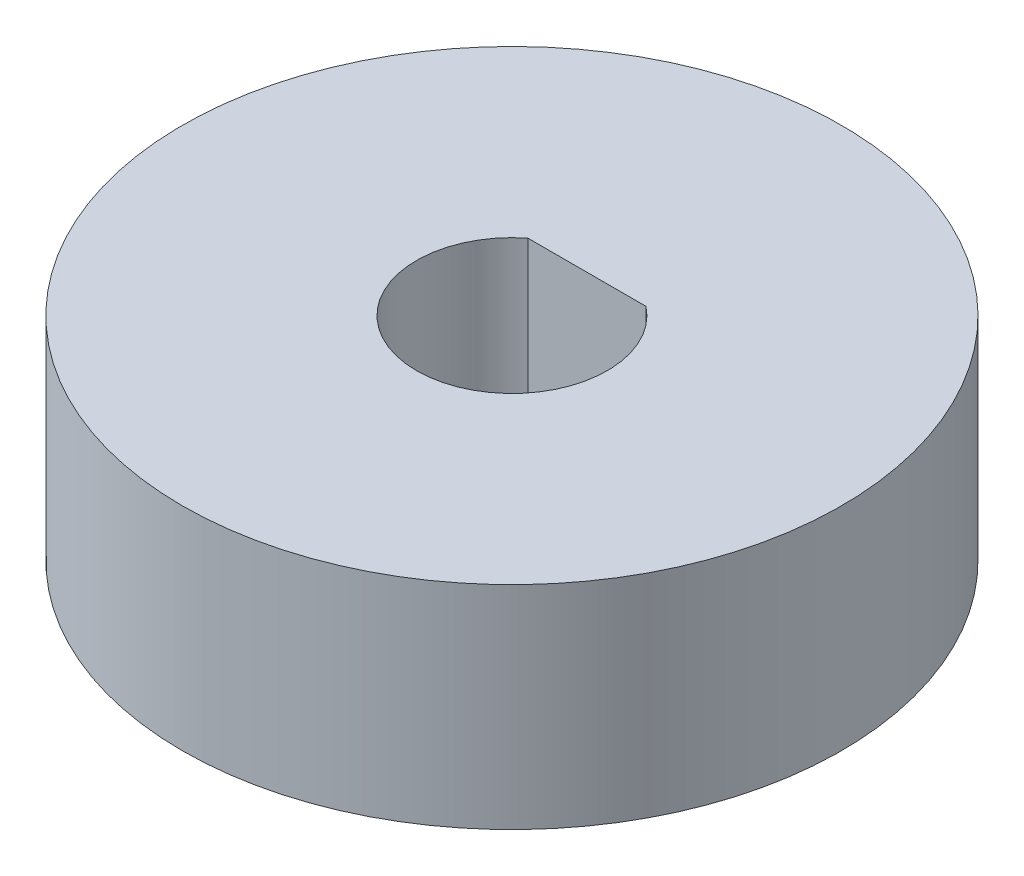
ISO-10303-21;
HEADER;
FILE_DESCRIPTION(('STEP AP214'),'2;1');
FILE_NAME('part.step','',(''),(''),'','','');
FILE_SCHEMA(('AUTOMOTIVE_DESIGN { 1 0 10303 214 1 1 1 1 }'));
ENDSEC;
DATA;
#1=APPLICATION_CONTEXT('core data for automotive mechanical design processes');
#2=APPLICATION_PROTOCOL_DEFINITION('international standard','automotive_design',2000,#1);
#3=PRODUCT_CONTEXT('',#1,'mechanical');
#4=PRODUCT('Part','Part','',(#3));
#5=PRODUCT_RELATED_PRODUCT_CATEGORY('part','',(#4));
#6=PRODUCT_DEFINITION_FORMATION('','',#4);
#7=PRODUCT_DEFINITION_CONTEXT('part definition',#1,'design');
#8=PRODUCT_DEFINITION('design','',#6,#7);
#9=PRODUCT_DEFINITION_SHAPE('','',#8);
#10=(LENGTH_UNIT() NAMED_UNIT(*) SI_UNIT(.MILLI.,.METRE.));
#11=(NAMED_UNIT(*) PLANE_ANGLE_UNIT() SI_UNIT($,.RADIAN.));
#12=(NAMED_UNIT(*) SI_UNIT($,.STERADIAN.) SOLID_ANGLE_UNIT());
#13=UNCERTAINTY_MEASURE_WITH_UNIT(LENGTH_MEASURE(1.E-05),#10,'distance_accuracy_value','');
#14=(GEOMETRIC_REPRESENTATION_CONTEXT(3) GLOBAL_UNCERTAINTY_ASSIGNED_CONTEXT((#13)) GLOBAL_UNIT_ASSIGNED_CONTEXT((#10,
#11,#12)) REPRESENTATION_CONTEXT('',''));
#15=CARTESIAN_POINT('',(0.,0.,0.));
#16=DIRECTION('',(0.,0.,1.));
#17=DIRECTION('',(1.,0.,0.));
#18=AXIS2_PLACEMENT_3D('',#15,#16,#17);
#19=CARTESIAN_POINT('',(0.,7.,0.));
#20=DIRECTION('',(0.,1.,0.));
#21=DIRECTION('',(0.,0.,1.));
#22=AXIS2_PLACEMENT_3D('',#19,#20,#21);
#23=PLANE('',#22);
#24=CARTESIAN_POINT('',(0.,7.,0.));
#25=DIRECTION('',(0.,1.,0.));
#26=DIRECTION('',(0.,0.,1.));
#27=AXIS2_PLACEMENT_3D('',#24,#25,#26);
#28=CIRCLE('',#27,10.875);
#29=CARTESIAN_POINT('',(0.,7.,10.875));
#30=VERTEX_POINT('',#29);
#31=EDGE_CURVE('E11',#30,#30,#28,.T.);
#32=ORIENTED_EDGE('',*,*,#31,.T.);
#33=EDGE_LOOP('',(#32));
#34=FACE_BOUND('',#33,.T.);
#35=DIRECTION('',(-1.,0.,0.));
#36=VECTOR('',#35,1.);
#37=CARTESIAN_POINT('',(1.94779481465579,7.,-2.4756));
#38=LINE('',#37,#36);
#39=CARTESIAN_POINT('',(1.94779481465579,7.,-2.4756));
#40=VERTEX_POINT('',#39);
#41=CARTESIAN_POINT('',(-1.94779481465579,7.,-2.4756));
#42=VERTEX_POINT('',#41);
#43=EDGE_CURVE('E72',#40,#42,#38,.T.);
#44=ORIENTED_EDGE('',*,*,#43,.F.);
#45=CARTESIAN_POINT('',(0.,7.,0.));
#46=DIRECTION('',(0.,1.,0.));
#47=DIRECTION('',(0.,0.,1.));
#48=AXIS2_PLACEMENT_3D('',#45,#46,#47);
#49=CIRCLE('',#48,3.15);
#50=EDGE_CURVE('E63',#42,#40,#49,.T.);
#51=ORIENTED_EDGE('',*,*,#50,.F.);
#52=EDGE_LOOP('',(#44,#51));
#53=FACE_BOUND('',#52,.T.);
#54=ADVANCED_FACE('F31',(#34,#53),#23,.T.);
#55=CARTESIAN_POINT('',(0.,0.,0.));
#56=DIRECTION('',(0.,1.,0.));
#57=DIRECTION('',(0.,0.,1.));
#58=AXIS2_PLACEMENT_3D('',#55,#56,#57);
#59=PLANE('',#58);
#60=CARTESIAN_POINT('',(0.,0.,0.));
#61=DIRECTION('',(0.,1.,0.));
#62=DIRECTION('',(0.,0.,1.));
#63=AXIS2_PLACEMENT_3D('',#60,#61,#62);
#64=CIRCLE('',#63,10.875);
#65=CARTESIAN_POINT('',(0.,0.,10.875));
#66=VERTEX_POINT('',#65);
#67=EDGE_CURVE('E35',#66,#66,#64,.T.);
#68=ORIENTED_EDGE('',*,*,#67,.F.);
#69=EDGE_LOOP('',(#68));
#70=FACE_BOUND('',#69,.T.);
#71=CARTESIAN_POINT('',(0.,0.,0.));
#72=DIRECTION('',(0.,1.,0.));
#73=DIRECTION('',(0.,0.,1.));
#74=AXIS2_PLACEMENT_3D('',#71,#72,#73);
#75=CIRCLE('',#74,3.15);
#76=CARTESIAN_POINT('',(-1.94779481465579,0.,-2.4756));
#77=VERTEX_POINT('',#76);
#78=CARTESIAN_POINT('',(1.94779481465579,0.,-2.4756));
#79=VERTEX_POINT('',#78);
#80=EDGE_CURVE('E53',#77,#79,#75,.T.);
#81=ORIENTED_EDGE('',*,*,#80,.T.);
#82=DIRECTION('',(-1.,0.,0.));
#83=VECTOR('',#82,1.);
#84=CARTESIAN_POINT('',(1.94779481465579,0.,-2.4756));
#85=LINE('',#84,#83);
#86=EDGE_CURVE('E59',#79,#77,#85,.T.);
#87=ORIENTED_EDGE('',*,*,#86,.T.);
#88=EDGE_LOOP('',(#81,#87));
#89=FACE_BOUND('',#88,.T.);
#90=ADVANCED_FACE('F69',(#70,#89),#59,.F.);
#91=CARTESIAN_POINT('',(0.,7.,0.));
#92=DIRECTION('',(0.,-1.,0.));
#93=DIRECTION('',(0.,0.,-1.));
#94=AXIS2_PLACEMENT_3D('',#91,#92,#93);
#95=CYLINDRICAL_SURFACE('',#94,10.875);
#96=ORIENTED_EDGE('',*,*,#31,.F.);
#97=EDGE_LOOP('',(#96));
#98=FACE_BOUND('',#97,.T.);
#99=ORIENTED_EDGE('',*,*,#67,.T.);
#100=EDGE_LOOP('',(#99));
#101=FACE_BOUND('',#100,.T.);
#102=ADVANCED_FACE('F33',(#98,#101),#95,.T.);
#103=CARTESIAN_POINT('',(0.,7.,0.));
#104=DIRECTION('',(0.,-1.,0.));
#105=DIRECTION('',(0.,0.,-1.));
#106=AXIS2_PLACEMENT_3D('',#103,#104,#105);
#107=CYLINDRICAL_SURFACE('',#106,3.15);
#108=ORIENTED_EDGE('',*,*,#80,.F.);
#109=DIRECTION('',(0.,-1.,0.));
#110=VECTOR('',#109,1.);
#111=CARTESIAN_POINT('',(-1.94779481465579,7.,-2.4756));
#112=LINE('',#111,#110);
#113=EDGE_CURVE('E61',#42,#77,#112,.T.);
#114=ORIENTED_EDGE('',*,*,#113,.F.);
#115=ORIENTED_EDGE('',*,*,#50,.T.);
#116=DIRECTION('',(0.,-1.,0.));
#117=VECTOR('',#116,1.);
#118=CARTESIAN_POINT('',(1.94779481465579,7.,-2.4756));
#119=LINE('',#118,#117);
#120=EDGE_CURVE('E46',#40,#79,#119,.T.);
#121=ORIENTED_EDGE('',*,*,#120,.T.);
#122=EDGE_LOOP('',(#108,#114,#115,#121));
#123=FACE_BOUND('',#122,.T.);
#124=ADVANCED_FACE('F65',(#123),#107,.F.);
#125=CARTESIAN_POINT('',(1.94779481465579,7.,-2.4756));
#126=DIRECTION('',(0.,0.,1.));
#127=DIRECTION('',(1.,0.,0.));
#128=AXIS2_PLACEMENT_3D('',#125,#126,#127);
#129=PLANE('',#128);
#130=ORIENTED_EDGE('',*,*,#86,.F.);
#131=ORIENTED_EDGE('',*,*,#120,.F.);
#132=ORIENTED_EDGE('',*,*,#43,.T.);
#133=ORIENTED_EDGE('',*,*,#113,.T.);
#134=EDGE_LOOP('',(#130,#131,#132,#133));
#135=FACE_BOUND('',#134,.T.);
#136=ADVANCED_FACE('F60',(#135),#129,.T.);
#137=CLOSED_SHELL('',(#54,#90,#102,#124,#136));
#138=MANIFOLD_SOLID_BREP('B2',#137);
#139=ADVANCED_BREP_SHAPE_REPRESENTATION('',(#18,#138),#14);
#140=SHAPE_DEFINITION_REPRESENTATION(#9,#139);
ENDSEC;
END-ISO-10303-21;
